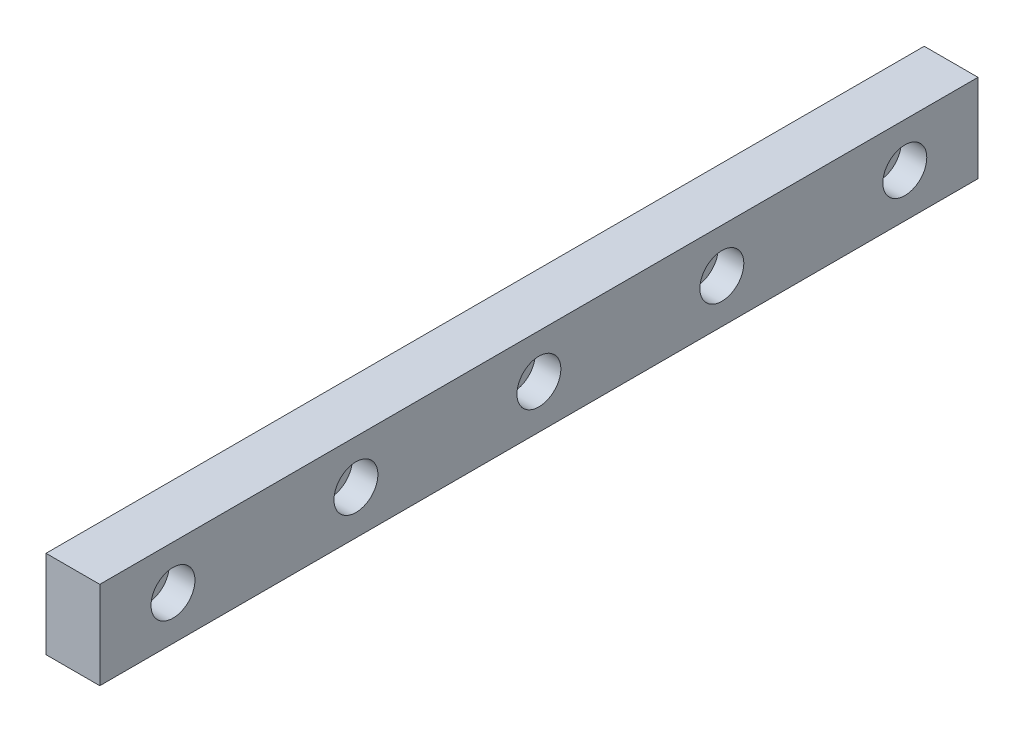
from build123d import *

# Parameters (mm, degrees)
SKETCH_1_W          = 7.35
SKETCH_1_H          = 12
EXTRUDE_1_DEPTH     = 120
SKETCH_2_R          = 1.75
CUT_EXTRUDE_1_DEPTH = 120
SKETCH_3_R          = 3
CUT_EXTRUDE_2_DEPTH = 3.5


with BuildPart() as part:
    # Sketch 1 → Extrude 1 (new body)
    with BuildSketch(Plane.XY):
        with Locations((3.675, 6)):
            Rectangle(SKETCH_1_W, SKETCH_1_H)
    extrude(amount=EXTRUDE_1_DEPTH)

    # Sketch 2 → Cut-Extrude 1 (cut)
    with BuildSketch(Plane(origin=(7.35, 0, 0), x_dir=(0, 0, -1), z_dir=(1, 0, 0))):
        with Locations((-10, 6)):
            Circle(SKETCH_2_R)
        with Locations((-60, 6)):
            Circle(SKETCH_2_R)
        with Locations((-85, 6)):
            Circle(SKETCH_2_R)
        with Locations((-110, 6)):
            Circle(SKETCH_2_R)
        with Locations((-35, 6)):
            Circle(SKETCH_2_R)
    extrude(amount=-CUT_EXTRUDE_1_DEPTH, mode=Mode.SUBTRACT)

    # Sketch 3 → Cut-Extrude 2 (cut)
    with BuildSketch(Plane(origin=(7.35, 0, 0), x_dir=(0, 0, -1), z_dir=(1, 0, 0))):
        with Locations((-10, 6)):
            Circle(SKETCH_3_R)
        with Locations((-60, 6)):
            Circle(SKETCH_3_R)
        with Locations((-85, 6)):
            Circle(SKETCH_3_R)
        with Locations((-110, 6)):
            Circle(SKETCH_3_R)
        with Locations((-35, 6)):
            Circle(SKETCH_3_R)
    extrude(amount=-CUT_EXTRUDE_2_DEPTH, mode=Mode.SUBTRACT)


solid = part.part
